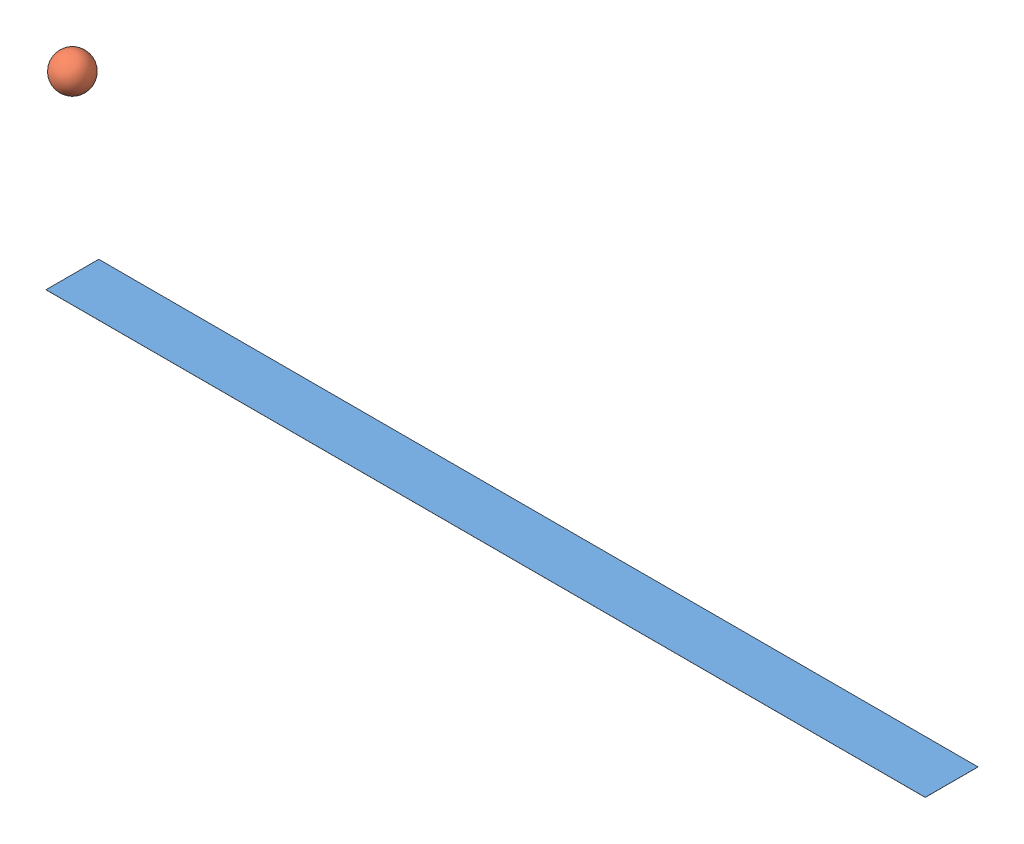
SolidWorks assembly Assem2.sldasm, configuration Default (file format 3400). Lengths in mm.
Overall size (12954 2795 762).
2 component instances, 2 part files, 3 mates.
Components (placement in the parent):
- Ground-1: Ground.SLDPRT [Default] at origin size (12700 1 762)
- ball-1: ball.SLDPRT [Default] at (0 2540 0) size (508 508 508)
Mates (geometry in assembly coordinates):
- Distance1: distance = 2540 mm aligned: plane of ?; plane of ?
- Coincident2: coincident aligned: plane of ?; plane of ?
- Coincident3: coincident aligned: plane of ?; plane of ?
